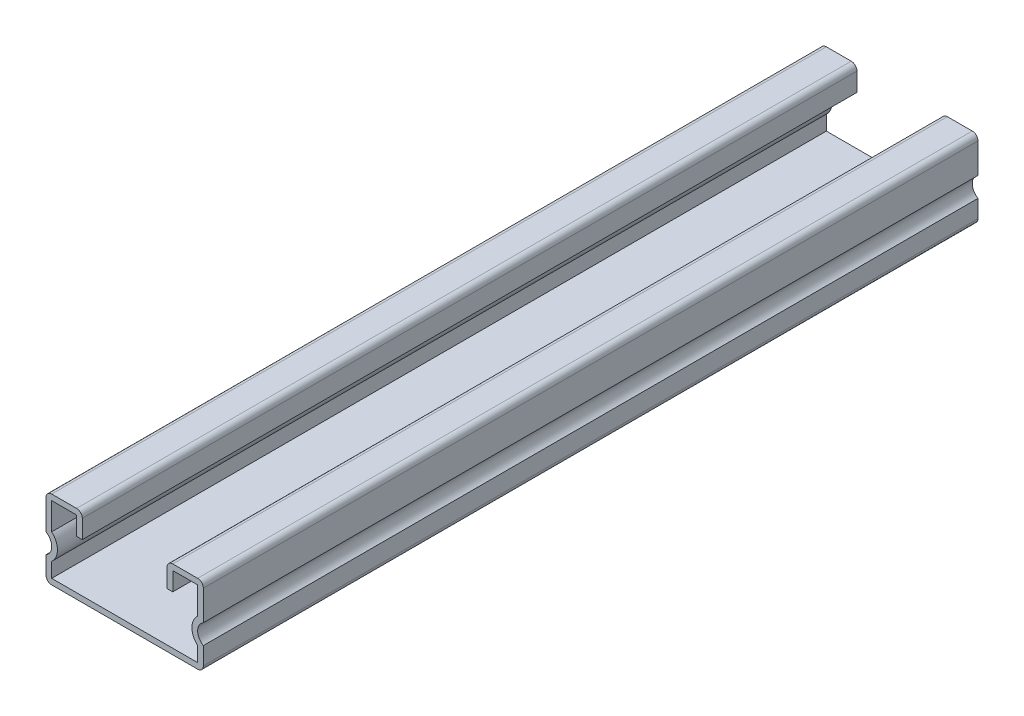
from build123d import *

# Parameters (mm, degrees)
BASE_EXTRUDE_DEPTH = 203.2
SLOT_DEPTH         = 217.924541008
LPATTERN1_COUNT    = 2
LPATTERN1_PITCH    = 101.6


with BuildPart() as part:
    # Sketch1 → Base-Extrude (new body)
    with BuildSketch(Plane.XY):
        with BuildLine():
            Line((-20.6375, 10.4394), (-20.6375, 2.59565134))
            ThreePointArc((-20.6375, 2.59565134), (-19.1389, 0), (-20.6375, -2.59565134))
            Line((-20.6375, -2.59565134), (-20.6375, -7.2136))
            ThreePointArc((-20.6375, -7.2136), (-20.198570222, -8.273270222), (-19.1389, -8.7122))
            Line((-19.1389, -8.7122), (19.1389, -8.7122))
            ThreePointArc((19.1389, -8.7122), (20.198570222, -8.273270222), (20.6375, -7.2136))
            Line((20.6375, -7.2136), (20.6375, -2.59565134))
            ThreePointArc((20.6375, -2.59565134), (19.1389, 0), (20.6375, 2.59565134))
            Line((20.6375, 2.59565134), (20.6375, 10.4394))
            ThreePointArc((20.6375, 10.4394), (20.198570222, 11.499070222), (19.1389, 11.938))
            Line((19.1389, 11.938), (12.6111, 11.938))
            ThreePointArc((12.6111, 11.938), (11.551429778, 11.499070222), (11.1125, 10.4394))
            Line((11.1125, 10.4394), (11.1125, 5.588))
            Line((11.1125, 5.588), (12.6111, 5.588))
            Line((12.6111, 5.588), (12.6111, 10.4394))
            Line((12.6111, 10.4394), (19.1389, 10.4394))
            Line((19.1389, 10.4394), (19.1389, 3.350971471))
            ThreePointArc((19.1389, 3.350971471), (17.6403, 0), (19.1389, -3.350971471))
            Line((19.1389, -3.350971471), (19.1389, -7.2136))
            Line((19.1389, -7.2136), (-19.1389, -7.2136))
            Line((-19.1389, -7.2136), (-19.1389, -3.350971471))
            ThreePointArc((-19.1389, -3.350971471), (-17.6403, 0), (-19.1389, 3.350971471))
            Line((-19.1389, 3.350971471), (-19.1389, 10.4394))
            Line((-19.1389, 10.4394), (-12.6111, 10.4394))
            Line((-12.6111, 10.4394), (-12.6111, 5.588))
            Line((-12.6111, 5.588), (-11.1125, 5.588))
            Line((-11.1125, 5.588), (-11.1125, 10.4394))
            ThreePointArc((-11.1125, 10.4394), (-11.551429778, 11.499070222), (-12.6111, 11.938))
            Line((-12.6111, 11.938), (-19.1389, 11.938))
            ThreePointArc((-19.1389, 11.938), (-20.198570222, 11.499070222), (-20.6375, 10.4394))
        make_face()
    extrude(amount=BASE_EXTRUDE_DEPTH)

    # Sketch2 → Slot (cut, through all)
    with BuildSketch(Plane(origin=(-0.747608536, -8.7122, -11.677878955), x_dir=(1, 0, 0), z_dir=(0, -1, 0))):
        with BuildLine():
            Line((5.906983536, 90.259128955), (5.906983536, 24.377878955))
            ThreePointArc((5.906983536, 24.377878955), (0.747608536, 19.218503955), (-4.411766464, 24.377878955))
            Line((-4.411766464, 24.377878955), (-4.411766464, 90.259128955))
            ThreePointArc((-4.411766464, 90.259128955), (0.747608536, 95.418503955), (5.906983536, 90.259128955))
        make_face()
    slot = extrude(amount=-SLOT_DEPTH, mode=Mode.SUBTRACT)

    # LPattern1: Slot ×2
    with Locations(*[(0, 0, i * LPATTERN1_PITCH) for i in range(1, LPATTERN1_COUNT)]):
        add(slot, mode=Mode.SUBTRACT)


solid = part.part
